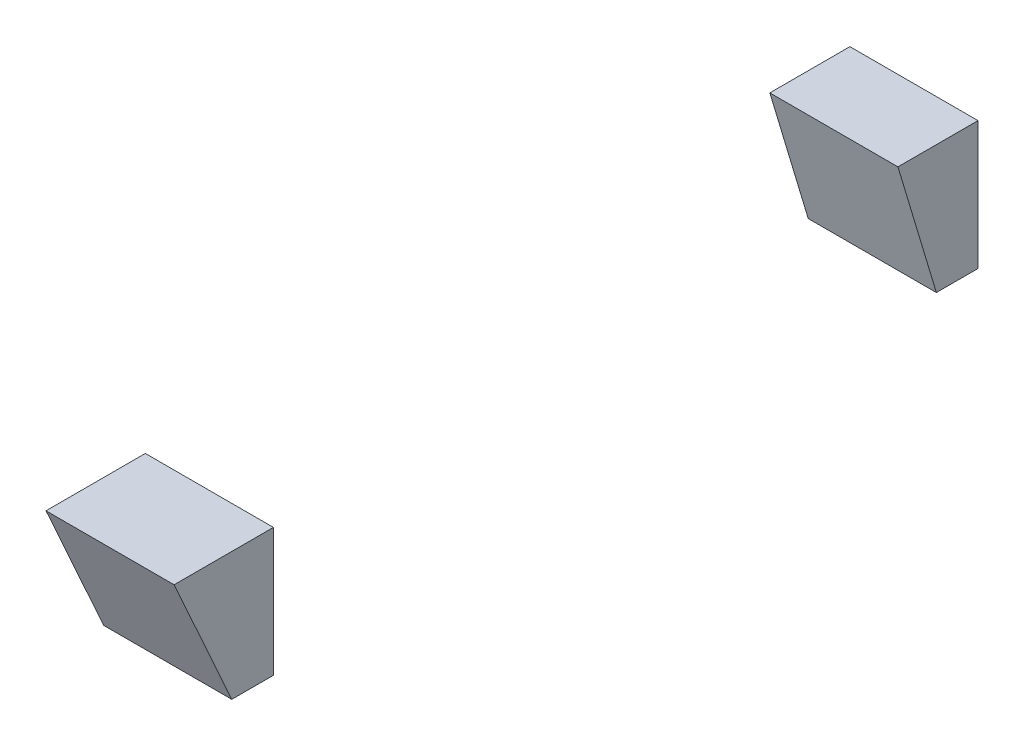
ISO-10303-21;
HEADER;
FILE_DESCRIPTION(('STEP AP214'),'2;1');
FILE_NAME('part.step','',(''),(''),'','','');
FILE_SCHEMA(('AUTOMOTIVE_DESIGN { 1 0 10303 214 1 1 1 1 }'));
ENDSEC;
DATA;
#1=APPLICATION_CONTEXT('core data for automotive mechanical design processes');
#2=APPLICATION_PROTOCOL_DEFINITION('international standard','automotive_design',2000,#1);
#3=PRODUCT_CONTEXT('',#1,'mechanical');
#4=PRODUCT('Part','Part','',(#3));
#5=PRODUCT_RELATED_PRODUCT_CATEGORY('part','',(#4));
#6=PRODUCT_DEFINITION_FORMATION('','',#4);
#7=PRODUCT_DEFINITION_CONTEXT('part definition',#1,'design');
#8=PRODUCT_DEFINITION('design','',#6,#7);
#9=PRODUCT_DEFINITION_SHAPE('','',#8);
#10=(LENGTH_UNIT() NAMED_UNIT(*) SI_UNIT(.MILLI.,.METRE.));
#11=(NAMED_UNIT(*) PLANE_ANGLE_UNIT() SI_UNIT($,.RADIAN.));
#12=(NAMED_UNIT(*) SI_UNIT($,.STERADIAN.) SOLID_ANGLE_UNIT());
#13=UNCERTAINTY_MEASURE_WITH_UNIT(LENGTH_MEASURE(1.E-05),#10,'distance_accuracy_value','');
#14=(GEOMETRIC_REPRESENTATION_CONTEXT(3) GLOBAL_UNCERTAINTY_ASSIGNED_CONTEXT((#13)) GLOBAL_UNIT_ASSIGNED_CONTEXT((#10,
#11,#12)) REPRESENTATION_CONTEXT('',''));
#15=CARTESIAN_POINT('',(0.,0.,0.));
#16=DIRECTION('',(0.,0.,1.));
#17=DIRECTION('',(1.,0.,0.));
#18=AXIS2_PLACEMENT_3D('',#15,#16,#17);
#19=CARTESIAN_POINT('',(9.00000000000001,13.,5.));
#20=DIRECTION('',(0.,-1.,0.));
#21=DIRECTION('',(0.,0.,-1.));
#22=AXIS2_PLACEMENT_3D('',#19,#20,#21);
#23=PLANE('',#22);
#24=DIRECTION('',(-1.,0.,0.));
#25=VECTOR('',#24,1.);
#26=CARTESIAN_POINT('',(91.8849382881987,13.,2.5));
#27=LINE('',#26,#25);
#28=CARTESIAN_POINT('',(13.,13.,2.5));
#29=VERTEX_POINT('',#28);
#30=CARTESIAN_POINT('',(9.00000000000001,13.,2.5));
#31=VERTEX_POINT('',#30);
#32=EDGE_CURVE('E91',#29,#31,#27,.T.);
#33=ORIENTED_EDGE('',*,*,#32,.F.);
#34=DIRECTION('',(0.,0.,-1.));
#35=VECTOR('',#34,1.);
#36=CARTESIAN_POINT('',(13.,13.,5.));
#37=LINE('',#36,#35);
#38=CARTESIAN_POINT('',(13.,13.,0.));
#39=VERTEX_POINT('',#38);
#40=EDGE_CURVE('E103',#29,#39,#37,.T.);
#41=ORIENTED_EDGE('',*,*,#40,.T.);
#42=DIRECTION('',(-1.,0.,0.));
#43=VECTOR('',#42,1.);
#44=CARTESIAN_POINT('',(9.00000000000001,13.,0.));
#45=LINE('',#44,#43);
#46=CARTESIAN_POINT('',(9.00000000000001,13.,0.));
#47=VERTEX_POINT('',#46);
#48=EDGE_CURVE('E110',#39,#47,#45,.T.);
#49=ORIENTED_EDGE('',*,*,#48,.T.);
#50=DIRECTION('',(0.,0.,-1.));
#51=VECTOR('',#50,1.);
#52=CARTESIAN_POINT('',(9.00000000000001,13.,5.));
#53=LINE('',#52,#51);
#54=EDGE_CURVE('E108',#31,#47,#53,.T.);
#55=ORIENTED_EDGE('',*,*,#54,.F.);
#56=EDGE_LOOP('',(#33,#41,#49,#55));
#57=FACE_BOUND('',#56,.T.);
#58=ADVANCED_FACE('F49',(#57),#23,.F.);
#59=CARTESIAN_POINT('',(9.00000000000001,9.,5.));
#60=DIRECTION('',(1.,0.,0.));
#61=DIRECTION('',(0.,0.,-1.));
#62=AXIS2_PLACEMENT_3D('',#59,#60,#61);
#63=PLANE('',#62);
#64=DIRECTION('',(0.,0.,-1.));
#65=VECTOR('',#64,1.);
#66=CARTESIAN_POINT('',(9.00000000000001,9.,5.));
#67=LINE('',#66,#65);
#68=CARTESIAN_POINT('',(9.00000000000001,9.,1.3));
#69=VERTEX_POINT('',#68);
#70=CARTESIAN_POINT('',(9.00000000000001,9.,0.));
#71=VERTEX_POINT('',#70);
#72=EDGE_CURVE('E70',#69,#71,#67,.T.);
#73=ORIENTED_EDGE('',*,*,#72,.F.);
#74=DIRECTION('',(0.,0.957826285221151,0.287347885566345));
#75=VECTOR('',#74,1.);
#76=CARTESIAN_POINT('',(9.00000000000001,10.0183486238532,1.60550458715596));
#77=LINE('',#76,#75);
#78=EDGE_CURVE('E88',#69,#31,#77,.T.);
#79=ORIENTED_EDGE('',*,*,#78,.T.);
#80=ORIENTED_EDGE('',*,*,#54,.T.);
#81=DIRECTION('',(0.,-1.,0.));
#82=VECTOR('',#81,1.);
#83=CARTESIAN_POINT('',(9.00000000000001,9.,0.));
#84=LINE('',#83,#82);
#85=EDGE_CURVE('E57',#47,#71,#84,.T.);
#86=ORIENTED_EDGE('',*,*,#85,.T.);
#87=EDGE_LOOP('',(#73,#79,#80,#86));
#88=FACE_BOUND('',#87,.T.);
#89=ADVANCED_FACE('F100',(#88),#63,.F.);
#90=CARTESIAN_POINT('',(13.,9.,5.));
#91=DIRECTION('',(0.,1.,0.));
#92=DIRECTION('',(0.,0.,1.));
#93=AXIS2_PLACEMENT_3D('',#90,#91,#92);
#94=PLANE('',#93);
#95=DIRECTION('',(0.,0.,-1.));
#96=VECTOR('',#95,1.);
#97=CARTESIAN_POINT('',(13.,9.,5.));
#98=LINE('',#97,#96);
#99=CARTESIAN_POINT('',(13.,9.,1.3));
#100=VERTEX_POINT('',#99);
#101=CARTESIAN_POINT('',(13.,9.,0.));
#102=VERTEX_POINT('',#101);
#103=EDGE_CURVE('E97',#100,#102,#98,.T.);
#104=ORIENTED_EDGE('',*,*,#103,.F.);
#105=DIRECTION('',(-1.,0.,0.));
#106=VECTOR('',#105,1.);
#107=CARTESIAN_POINT('',(91.8849382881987,9.,1.3));
#108=LINE('',#107,#106);
#109=EDGE_CURVE('E64',#100,#69,#108,.T.);
#110=ORIENTED_EDGE('',*,*,#109,.T.);
#111=ORIENTED_EDGE('',*,*,#72,.T.);
#112=DIRECTION('',(1.,0.,0.));
#113=VECTOR('',#112,1.);
#114=CARTESIAN_POINT('',(13.,9.,0.));
#115=LINE('',#114,#113);
#116=EDGE_CURVE('E116',#71,#102,#115,.T.);
#117=ORIENTED_EDGE('',*,*,#116,.T.);
#118=EDGE_LOOP('',(#104,#110,#111,#117));
#119=FACE_BOUND('',#118,.T.);
#120=ADVANCED_FACE('F96',(#119),#94,.F.);
#121=CARTESIAN_POINT('',(13.,13.,5.));
#122=DIRECTION('',(-1.,0.,0.));
#123=DIRECTION('',(0.,0.,1.));
#124=AXIS2_PLACEMENT_3D('',#121,#122,#123);
#125=PLANE('',#124);
#126=ORIENTED_EDGE('',*,*,#40,.F.);
#127=DIRECTION('',(0.,-0.957826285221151,-0.287347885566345));
#128=VECTOR('',#127,1.);
#129=CARTESIAN_POINT('',(13.,13.6880733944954,2.70642201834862));
#130=LINE('',#129,#128);
#131=EDGE_CURVE('E12',#29,#100,#130,.T.);
#132=ORIENTED_EDGE('',*,*,#131,.T.);
#133=ORIENTED_EDGE('',*,*,#103,.T.);
#134=DIRECTION('',(0.,1.,0.));
#135=VECTOR('',#134,1.);
#136=CARTESIAN_POINT('',(13.,13.,0.));
#137=LINE('',#136,#135);
#138=EDGE_CURVE('E113',#102,#39,#137,.T.);
#139=ORIENTED_EDGE('',*,*,#138,.T.);
#140=EDGE_LOOP('',(#126,#132,#133,#139));
#141=FACE_BOUND('',#140,.T.);
#142=ADVANCED_FACE('F122',(#141),#125,.F.);
#143=CARTESIAN_POINT('',(0.,0.,0.));
#144=DIRECTION('',(0.,0.,-1.));
#145=DIRECTION('',(-1.,0.,0.));
#146=AXIS2_PLACEMENT_3D('',#143,#144,#145);
#147=PLANE('',#146);
#148=ORIENTED_EDGE('',*,*,#85,.F.);
#149=ORIENTED_EDGE('',*,*,#48,.F.);
#150=ORIENTED_EDGE('',*,*,#138,.F.);
#151=ORIENTED_EDGE('',*,*,#116,.F.);
#152=EDGE_LOOP('',(#148,#149,#150,#151));
#153=FACE_BOUND('',#152,.T.);
#154=ADVANCED_FACE('F51',(#153),#147,.T.);
#155=CARTESIAN_POINT('',(91.8849382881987,13.,2.5));
#156=DIRECTION('',(0.,0.287347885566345,-0.957826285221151));
#157=DIRECTION('',(0.,0.957826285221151,0.287347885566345));
#158=AXIS2_PLACEMENT_3D('',#155,#156,#157);
#159=PLANE('',#158);
#160=ORIENTED_EDGE('',*,*,#78,.F.);
#161=ORIENTED_EDGE('',*,*,#109,.F.);
#162=ORIENTED_EDGE('',*,*,#131,.F.);
#163=ORIENTED_EDGE('',*,*,#32,.T.);
#164=EDGE_LOOP('',(#160,#161,#162,#163));
#165=FACE_BOUND('',#164,.T.);
#166=ADVANCED_FACE('F89',(#165),#159,.F.);
#167=CLOSED_SHELL('',(#58,#89,#120,#142,#154,#166));
#168=MANIFOLD_SOLID_BREP('B2',#167);
#169=CARTESIAN_POINT('',(-8.99999999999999,-13.,5.));
#170=DIRECTION('',(0.,1.,0.));
#171=DIRECTION('',(0.,0.,1.));
#172=AXIS2_PLACEMENT_3D('',#169,#170,#171);
#173=PLANE('',#172);
#174=DIRECTION('',(1.,0.,0.));
#175=VECTOR('',#174,1.);
#176=CARTESIAN_POINT('',(-86.8849382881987,-13.,1.3));
#177=LINE('',#176,#175);
#178=CARTESIAN_POINT('',(-13.,-13.,1.3));
#179=VERTEX_POINT('',#178);
#180=CARTESIAN_POINT('',(-8.99999999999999,-13.,1.3));
#181=VERTEX_POINT('',#180);
#182=EDGE_CURVE('E200',#179,#181,#177,.T.);
#183=ORIENTED_EDGE('',*,*,#182,.F.);
#184=DIRECTION('',(0.,0.,-1.));
#185=VECTOR('',#184,1.);
#186=CARTESIAN_POINT('',(-13.,-13.,5.));
#187=LINE('',#186,#185);
#188=CARTESIAN_POINT('',(-13.,-13.,0.));
#189=VERTEX_POINT('',#188);
#190=EDGE_CURVE('E193',#179,#189,#187,.T.);
#191=ORIENTED_EDGE('',*,*,#190,.T.);
#192=DIRECTION('',(1.,0.,0.));
#193=VECTOR('',#192,1.);
#194=CARTESIAN_POINT('',(-8.99999999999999,-13.,0.));
#195=LINE('',#194,#193);
#196=CARTESIAN_POINT('',(-8.99999999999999,-13.,0.));
#197=VERTEX_POINT('',#196);
#198=EDGE_CURVE('E250',#189,#197,#195,.T.);
#199=ORIENTED_EDGE('',*,*,#198,.T.);
#200=DIRECTION('',(0.,0.,-1.));
#201=VECTOR('',#200,1.);
#202=CARTESIAN_POINT('',(-8.99999999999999,-13.,5.));
#203=LINE('',#202,#201);
#204=EDGE_CURVE('E240',#181,#197,#203,.T.);
#205=ORIENTED_EDGE('',*,*,#204,.F.);
#206=EDGE_LOOP('',(#183,#191,#199,#205));
#207=FACE_BOUND('',#206,.T.);
#208=ADVANCED_FACE('F185',(#207),#173,.F.);
#209=CARTESIAN_POINT('',(-13.,-13.,5.));
#210=DIRECTION('',(1.,0.,0.));
#211=DIRECTION('',(0.,0.,-1.));
#212=AXIS2_PLACEMENT_3D('',#209,#210,#211);
#213=PLANE('',#212);
#214=ORIENTED_EDGE('',*,*,#190,.F.);
#215=DIRECTION('',(0.,0.911837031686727,0.410552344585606));
#216=VECTOR('',#215,1.);
#217=CARTESIAN_POINT('',(-13.,-11.6148797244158,1.92364694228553));
#218=LINE('',#217,#216);
#219=CARTESIAN_POINT('',(-13.,-9.,3.10099000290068));
#220=VERTEX_POINT('',#219);
#221=EDGE_CURVE('E227',#179,#220,#218,.T.);
#222=ORIENTED_EDGE('',*,*,#221,.T.);
#223=DIRECTION('',(0.,0.,-1.));
#224=VECTOR('',#223,1.);
#225=CARTESIAN_POINT('',(-13.,-9.,5.));
#226=LINE('',#225,#224);
#227=CARTESIAN_POINT('',(-13.,-9.,0.));
#228=VERTEX_POINT('',#227);
#229=EDGE_CURVE('E207',#220,#228,#226,.T.);
#230=ORIENTED_EDGE('',*,*,#229,.T.);
#231=DIRECTION('',(0.,-1.,0.));
#232=VECTOR('',#231,1.);
#233=CARTESIAN_POINT('',(-13.,-13.,0.));
#234=LINE('',#233,#232);
#235=EDGE_CURVE('E232',#228,#189,#234,.T.);
#236=ORIENTED_EDGE('',*,*,#235,.T.);
#237=EDGE_LOOP('',(#214,#222,#230,#236));
#238=FACE_BOUND('',#237,.T.);
#239=ADVANCED_FACE('F187',(#238),#213,.F.);
#240=CARTESIAN_POINT('',(-8.99999999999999,-9.,5.));
#241=DIRECTION('',(-1.,0.,0.));
#242=DIRECTION('',(0.,0.,1.));
#243=AXIS2_PLACEMENT_3D('',#240,#241,#242);
#244=PLANE('',#243);
#245=DIRECTION('',(0.,0.,-1.));
#246=VECTOR('',#245,1.);
#247=CARTESIAN_POINT('',(-8.99999999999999,-9.,5.));
#248=LINE('',#247,#246);
#249=CARTESIAN_POINT('',(-8.99999999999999,-9.,3.10099000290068));
#250=VERTEX_POINT('',#249);
#251=CARTESIAN_POINT('',(-8.99999999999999,-9.,0.));
#252=VERTEX_POINT('',#251);
#253=EDGE_CURVE('E238',#250,#252,#248,.T.);
#254=ORIENTED_EDGE('',*,*,#253,.F.);
#255=DIRECTION('',(0.,-0.911837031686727,-0.410552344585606));
#256=VECTOR('',#255,1.);
#257=CARTESIAN_POINT('',(-8.99999999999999,-8.28909263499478,3.4210742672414));
#258=LINE('',#257,#256);
#259=EDGE_CURVE('E47',#250,#181,#258,.T.);
#260=ORIENTED_EDGE('',*,*,#259,.T.);
#261=ORIENTED_EDGE('',*,*,#204,.T.);
#262=DIRECTION('',(0.,1.,0.));
#263=VECTOR('',#262,1.);
#264=CARTESIAN_POINT('',(-8.99999999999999,-9.,0.));
#265=LINE('',#264,#263);
#266=EDGE_CURVE('E242',#197,#252,#265,.T.);
#267=ORIENTED_EDGE('',*,*,#266,.T.);
#268=EDGE_LOOP('',(#254,#260,#261,#267));
#269=FACE_BOUND('',#268,.T.);
#270=ADVANCED_FACE('F259',(#269),#244,.F.);
#271=CARTESIAN_POINT('',(-13.,-9.,5.));
#272=DIRECTION('',(0.,-1.,0.));
#273=DIRECTION('',(0.,0.,-1.));
#274=AXIS2_PLACEMENT_3D('',#271,#272,#273);
#275=PLANE('',#274);
#276=ORIENTED_EDGE('',*,*,#229,.F.);
#277=DIRECTION('',(1.,0.,0.));
#278=VECTOR('',#277,1.);
#279=CARTESIAN_POINT('',(-86.8849382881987,-9.,3.10099000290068));
#280=LINE('',#279,#278);
#281=EDGE_CURVE('E225',#220,#250,#280,.T.);
#282=ORIENTED_EDGE('',*,*,#281,.T.);
#283=ORIENTED_EDGE('',*,*,#253,.T.);
#284=DIRECTION('',(-1.,0.,0.));
#285=VECTOR('',#284,1.);
#286=CARTESIAN_POINT('',(-13.,-9.,0.));
#287=LINE('',#286,#285);
#288=EDGE_CURVE('E236',#252,#228,#287,.T.);
#289=ORIENTED_EDGE('',*,*,#288,.T.);
#290=EDGE_LOOP('',(#276,#282,#283,#289));
#291=FACE_BOUND('',#290,.T.);
#292=ADVANCED_FACE('F234',(#291),#275,.F.);
#293=CARTESIAN_POINT('',(0.,0.,0.));
#294=DIRECTION('',(0.,0.,-1.));
#295=DIRECTION('',(-1.,0.,0.));
#296=AXIS2_PLACEMENT_3D('',#293,#294,#295);
#297=PLANE('',#296);
#298=ORIENTED_EDGE('',*,*,#235,.F.);
#299=ORIENTED_EDGE('',*,*,#288,.F.);
#300=ORIENTED_EDGE('',*,*,#266,.F.);
#301=ORIENTED_EDGE('',*,*,#198,.F.);
#302=EDGE_LOOP('',(#298,#299,#300,#301));
#303=FACE_BOUND('',#302,.T.);
#304=ADVANCED_FACE('F253',(#303),#297,.T.);
#305=CARTESIAN_POINT('',(-86.8849382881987,-13.,1.3));
#306=DIRECTION('',(0.,0.410552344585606,-0.911837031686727));
#307=DIRECTION('',(0.,0.911837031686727,0.410552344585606));
#308=AXIS2_PLACEMENT_3D('',#305,#306,#307);
#309=PLANE('',#308);
#310=ORIENTED_EDGE('',*,*,#221,.F.);
#311=ORIENTED_EDGE('',*,*,#182,.T.);
#312=ORIENTED_EDGE('',*,*,#259,.F.);
#313=ORIENTED_EDGE('',*,*,#281,.F.);
#314=EDGE_LOOP('',(#310,#311,#312,#313));
#315=FACE_BOUND('',#314,.T.);
#316=ADVANCED_FACE('F226',(#315),#309,.F.);
#317=CLOSED_SHELL('',(#208,#239,#270,#292,#304,#316));
#318=MANIFOLD_SOLID_BREP('B6',#317);
#319=ADVANCED_BREP_SHAPE_REPRESENTATION('',(#18,#168,#318),#14);
#320=SHAPE_DEFINITION_REPRESENTATION(#9,#319);
ENDSEC;
END-ISO-10303-21;
